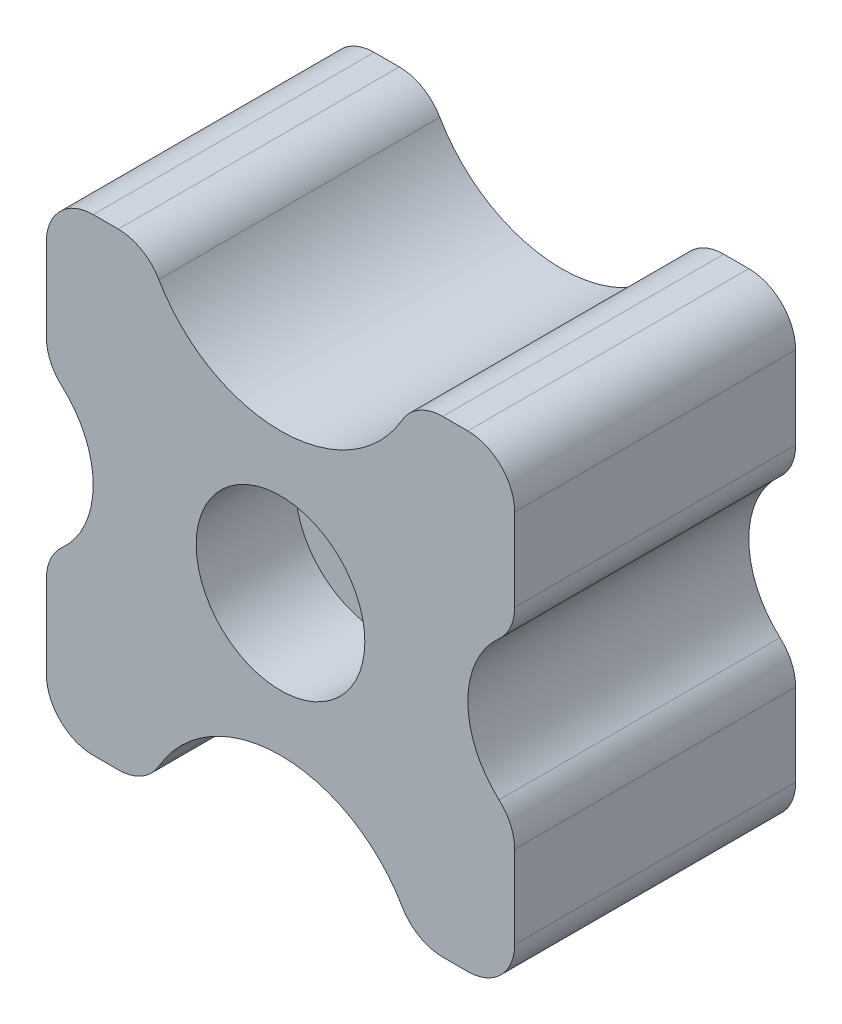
ISO-10303-21;
HEADER;
FILE_DESCRIPTION(('STEP AP214'),'2;1');
FILE_NAME('part.step','',(''),(''),'','','');
FILE_SCHEMA(('AUTOMOTIVE_DESIGN { 1 0 10303 214 1 1 1 1 }'));
ENDSEC;
DATA;
#1=APPLICATION_CONTEXT('core data for automotive mechanical design processes');
#2=APPLICATION_PROTOCOL_DEFINITION('international standard','automotive_design',2000,#1);
#3=PRODUCT_CONTEXT('',#1,'mechanical');
#4=PRODUCT('Part','Part','',(#3));
#5=PRODUCT_RELATED_PRODUCT_CATEGORY('part','',(#4));
#6=PRODUCT_DEFINITION_FORMATION('','',#4);
#7=PRODUCT_DEFINITION_CONTEXT('part definition',#1,'design');
#8=PRODUCT_DEFINITION('design','',#6,#7);
#9=PRODUCT_DEFINITION_SHAPE('','',#8);
#10=(LENGTH_UNIT() NAMED_UNIT(*) SI_UNIT(.MILLI.,.METRE.));
#11=(NAMED_UNIT(*) PLANE_ANGLE_UNIT() SI_UNIT($,.RADIAN.));
#12=(NAMED_UNIT(*) SI_UNIT($,.STERADIAN.) SOLID_ANGLE_UNIT());
#13=UNCERTAINTY_MEASURE_WITH_UNIT(LENGTH_MEASURE(1.E-05),#10,'distance_accuracy_value','');
#14=(GEOMETRIC_REPRESENTATION_CONTEXT(3) GLOBAL_UNCERTAINTY_ASSIGNED_CONTEXT((#13)) GLOBAL_UNIT_ASSIGNED_CONTEXT((#10,
#11,#12)) REPRESENTATION_CONTEXT('',''));
#15=CARTESIAN_POINT('',(0.,0.,0.));
#16=DIRECTION('',(0.,0.,1.));
#17=DIRECTION('',(1.,0.,0.));
#18=AXIS2_PLACEMENT_3D('',#15,#16,#17);
#19=CARTESIAN_POINT('',(25.,25.,30.));
#20=DIRECTION('',(0.,0.,-1.));
#21=DIRECTION('',(-1.,0.,0.));
#22=AXIS2_PLACEMENT_3D('',#19,#20,#21);
#23=PLANE('',#22);
#24=CARTESIAN_POINT('',(0.,0.,30.));
#25=DIRECTION('',(0.,0.,1.));
#26=DIRECTION('',(1.,0.,0.));
#27=AXIS2_PLACEMENT_3D('',#24,#25,#26);
#28=CIRCLE('',#27,9.);
#29=CARTESIAN_POINT('',(9.,0.,30.));
#30=VERTEX_POINT('',#29);
#31=EDGE_CURVE('E490',#30,#30,#28,.T.);
#32=ORIENTED_EDGE('',*,*,#31,.F.);
#33=EDGE_LOOP('',(#32));
#34=FACE_BOUND('',#33,.T.);
#35=DIRECTION('',(1.,0.,0.));
#36=VECTOR('',#35,1.);
#37=CARTESIAN_POINT('',(-25.,-25.,30.));
#38=LINE('',#37,#36);
#39=CARTESIAN_POINT('',(17.3205080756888,-25.,30.));
#40=VERTEX_POINT('',#39);
#41=CARTESIAN_POINT('',(20.,-25.,30.));
#42=VERTEX_POINT('',#41);
#43=EDGE_CURVE('E206',#40,#42,#38,.T.);
#44=ORIENTED_EDGE('',*,*,#43,.T.);
#45=CARTESIAN_POINT('',(20.,-20.,30.));
#46=DIRECTION('',(0.,0.,-1.));
#47=DIRECTION('',(-1.,0.,0.));
#48=AXIS2_PLACEMENT_3D('',#45,#46,#47);
#49=CIRCLE('',#48,5.);
#50=CARTESIAN_POINT('',(25.,-20.,30.));
#51=VERTEX_POINT('',#50);
#52=EDGE_CURVE('E200',#42,#51,#49,.F.);
#53=ORIENTED_EDGE('',*,*,#52,.T.);
#54=DIRECTION('',(0.,1.,0.));
#55=VECTOR('',#54,1.);
#56=CARTESIAN_POINT('',(25.,-25.,30.));
#57=LINE('',#56,#55);
#58=CARTESIAN_POINT('',(25.,-11.180339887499,30.));
#59=VERTEX_POINT('',#58);
#60=EDGE_CURVE('E203',#51,#59,#57,.T.);
#61=ORIENTED_EDGE('',*,*,#60,.T.);
#62=CARTESIAN_POINT('',(20.,-11.180339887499,30.));
#63=DIRECTION('',(0.,0.,-1.));
#64=DIRECTION('',(-1.,0.,0.));
#65=AXIS2_PLACEMENT_3D('',#62,#63,#64);
#66=CIRCLE('',#65,5.);
#67=CARTESIAN_POINT('',(23.3333333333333,-7.4535599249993,30.));
#68=VERTEX_POINT('',#67);
#69=EDGE_CURVE('E274',#59,#68,#66,.F.);
#70=ORIENTED_EDGE('',*,*,#69,.T.);
#71=CARTESIAN_POINT('',(30.,0.,30.));
#72=DIRECTION('',(0.,0.,1.));
#73=DIRECTION('',(-1.,0.,0.));
#74=AXIS2_PLACEMENT_3D('',#71,#72,#73);
#75=CIRCLE('',#74,10.);
#76=CARTESIAN_POINT('',(23.3333333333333,7.45355992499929,30.));
#77=VERTEX_POINT('',#76);
#78=EDGE_CURVE('E462',#77,#68,#75,.T.);
#79=ORIENTED_EDGE('',*,*,#78,.F.);
#80=CARTESIAN_POINT('',(20.,11.1803398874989,30.));
#81=DIRECTION('',(0.,0.,-1.));
#82=DIRECTION('',(-1.,0.,0.));
#83=AXIS2_PLACEMENT_3D('',#80,#81,#82);
#84=CIRCLE('',#83,5.);
#85=CARTESIAN_POINT('',(25.,11.1803398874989,30.));
#86=VERTEX_POINT('',#85);
#87=EDGE_CURVE('E271',#77,#86,#84,.F.);
#88=ORIENTED_EDGE('',*,*,#87,.T.);
#89=CARTESIAN_POINT('',(25.,20.,30.));
#90=VERTEX_POINT('',#89);
#91=EDGE_CURVE('E224',#86,#90,#57,.T.);
#92=ORIENTED_EDGE('',*,*,#91,.T.);
#93=CARTESIAN_POINT('',(20.,20.,30.));
#94=DIRECTION('',(0.,0.,-1.));
#95=DIRECTION('',(-1.,0.,0.));
#96=AXIS2_PLACEMENT_3D('',#93,#94,#95);
#97=CIRCLE('',#96,5.);
#98=CARTESIAN_POINT('',(20.,25.,30.));
#99=VERTEX_POINT('',#98);
#100=EDGE_CURVE('E60',#90,#99,#97,.F.);
#101=ORIENTED_EDGE('',*,*,#100,.T.);
#102=DIRECTION('',(-1.,0.,0.));
#103=VECTOR('',#102,1.);
#104=CARTESIAN_POINT('',(-25.,25.,30.));
#105=LINE('',#104,#103);
#106=CARTESIAN_POINT('',(17.3205080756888,25.,30.));
#107=VERTEX_POINT('',#106);
#108=EDGE_CURVE('E352',#99,#107,#105,.T.);
#109=ORIENTED_EDGE('',*,*,#108,.T.);
#110=CARTESIAN_POINT('',(17.3205080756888,20.,30.));
#111=DIRECTION('',(0.,0.,-1.));
#112=DIRECTION('',(-1.,0.,0.));
#113=AXIS2_PLACEMENT_3D('',#110,#111,#112);
#114=CIRCLE('',#113,5.);
#115=CARTESIAN_POINT('',(12.9903810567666,22.5,30.));
#116=VERTEX_POINT('',#115);
#117=EDGE_CURVE('E266',#107,#116,#114,.F.);
#118=ORIENTED_EDGE('',*,*,#117,.T.);
#119=CARTESIAN_POINT('',(0.,30.,30.));
#120=DIRECTION('',(0.,0.,1.));
#121=DIRECTION('',(-1.,0.,0.));
#122=AXIS2_PLACEMENT_3D('',#119,#120,#121);
#123=CIRCLE('',#122,15.);
#124=CARTESIAN_POINT('',(-12.9903810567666,22.5,30.));
#125=VERTEX_POINT('',#124);
#126=EDGE_CURVE('E471',#125,#116,#123,.T.);
#127=ORIENTED_EDGE('',*,*,#126,.F.);
#128=CARTESIAN_POINT('',(-17.3205080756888,20.,30.));
#129=DIRECTION('',(0.,0.,-1.));
#130=DIRECTION('',(-1.,0.,0.));
#131=AXIS2_PLACEMENT_3D('',#128,#129,#130);
#132=CIRCLE('',#131,5.);
#133=CARTESIAN_POINT('',(-17.3205080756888,25.,30.));
#134=VERTEX_POINT('',#133);
#135=EDGE_CURVE('E263',#125,#134,#132,.F.);
#136=ORIENTED_EDGE('',*,*,#135,.T.);
#137=CARTESIAN_POINT('',(-20.,25.,30.));
#138=VERTEX_POINT('',#137);
#139=EDGE_CURVE('E223',#134,#138,#105,.T.);
#140=ORIENTED_EDGE('',*,*,#139,.T.);
#141=CARTESIAN_POINT('',(-20.,20.,30.));
#142=DIRECTION('',(0.,0.,-1.));
#143=DIRECTION('',(-1.,0.,0.));
#144=AXIS2_PLACEMENT_3D('',#141,#142,#143);
#145=CIRCLE('',#144,5.);
#146=CARTESIAN_POINT('',(-25.,20.,30.));
#147=VERTEX_POINT('',#146);
#148=EDGE_CURVE('E260',#138,#147,#145,.F.);
#149=ORIENTED_EDGE('',*,*,#148,.T.);
#150=DIRECTION('',(0.,-1.,0.));
#151=VECTOR('',#150,1.);
#152=CARTESIAN_POINT('',(-25.,-25.,30.));
#153=LINE('',#152,#151);
#154=CARTESIAN_POINT('',(-25.,11.1803398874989,30.));
#155=VERTEX_POINT('',#154);
#156=EDGE_CURVE('E361',#147,#155,#153,.T.);
#157=ORIENTED_EDGE('',*,*,#156,.T.);
#158=CARTESIAN_POINT('',(-20.,11.1803398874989,30.));
#159=DIRECTION('',(0.,0.,-1.));
#160=DIRECTION('',(-1.,0.,0.));
#161=AXIS2_PLACEMENT_3D('',#158,#159,#160);
#162=CIRCLE('',#161,5.);
#163=CARTESIAN_POINT('',(-23.3333333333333,7.4535599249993,30.));
#164=VERTEX_POINT('',#163);
#165=EDGE_CURVE('E212',#155,#164,#162,.F.);
#166=ORIENTED_EDGE('',*,*,#165,.T.);
#167=CARTESIAN_POINT('',(-30.,0.,30.));
#168=DIRECTION('',(0.,0.,1.));
#169=DIRECTION('',(1.,0.,0.));
#170=AXIS2_PLACEMENT_3D('',#167,#168,#169);
#171=CIRCLE('',#170,10.);
#172=CARTESIAN_POINT('',(-23.3333333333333,-7.45355992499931,30.));
#173=VERTEX_POINT('',#172);
#174=EDGE_CURVE('E390',#173,#164,#171,.T.);
#175=ORIENTED_EDGE('',*,*,#174,.F.);
#176=CARTESIAN_POINT('',(-20.,-11.180339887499,30.));
#177=DIRECTION('',(0.,0.,-1.));
#178=DIRECTION('',(-1.,0.,0.));
#179=AXIS2_PLACEMENT_3D('',#176,#177,#178);
#180=CIRCLE('',#179,5.);
#181=CARTESIAN_POINT('',(-25.,-11.180339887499,30.));
#182=VERTEX_POINT('',#181);
#183=EDGE_CURVE('E286',#173,#182,#180,.F.);
#184=ORIENTED_EDGE('',*,*,#183,.T.);
#185=CARTESIAN_POINT('',(-25.,-20.,30.));
#186=VERTEX_POINT('',#185);
#187=EDGE_CURVE('E386',#182,#186,#153,.T.);
#188=ORIENTED_EDGE('',*,*,#187,.T.);
#189=CARTESIAN_POINT('',(-20.,-20.,30.));
#190=DIRECTION('',(0.,0.,-1.));
#191=DIRECTION('',(-1.,0.,0.));
#192=AXIS2_PLACEMENT_3D('',#189,#190,#191);
#193=CIRCLE('',#192,5.);
#194=CARTESIAN_POINT('',(-20.,-25.,30.));
#195=VERTEX_POINT('',#194);
#196=EDGE_CURVE('E283',#186,#195,#193,.F.);
#197=ORIENTED_EDGE('',*,*,#196,.T.);
#198=CARTESIAN_POINT('',(-17.3205080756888,-25.,30.));
#199=VERTEX_POINT('',#198);
#200=EDGE_CURVE('E376',#195,#199,#38,.T.);
#201=ORIENTED_EDGE('',*,*,#200,.T.);
#202=CARTESIAN_POINT('',(-17.3205080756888,-20.,30.));
#203=DIRECTION('',(0.,0.,-1.));
#204=DIRECTION('',(-1.,0.,0.));
#205=AXIS2_PLACEMENT_3D('',#202,#203,#204);
#206=CIRCLE('',#205,5.);
#207=CARTESIAN_POINT('',(-12.9903810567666,-22.5,30.));
#208=VERTEX_POINT('',#207);
#209=EDGE_CURVE('E277',#199,#208,#206,.F.);
#210=ORIENTED_EDGE('',*,*,#209,.T.);
#211=CARTESIAN_POINT('',(0.,-30.,30.));
#212=DIRECTION('',(0.,0.,1.));
#213=DIRECTION('',(1.,0.,0.));
#214=AXIS2_PLACEMENT_3D('',#211,#212,#213);
#215=CIRCLE('',#214,15.);
#216=CARTESIAN_POINT('',(12.9903810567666,-22.5,30.));
#217=VERTEX_POINT('',#216);
#218=EDGE_CURVE('E396',#217,#208,#215,.T.);
#219=ORIENTED_EDGE('',*,*,#218,.F.);
#220=CARTESIAN_POINT('',(17.3205080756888,-20.,30.));
#221=DIRECTION('',(0.,0.,-1.));
#222=DIRECTION('',(-1.,0.,0.));
#223=AXIS2_PLACEMENT_3D('',#220,#221,#222);
#224=CIRCLE('',#223,5.);
#225=EDGE_CURVE('E280',#217,#40,#224,.F.);
#226=ORIENTED_EDGE('',*,*,#225,.T.);
#227=EDGE_LOOP('',(#44,#53,#61,#70,#79,#88,#92,#101,#109,#118,#127,#136,#140,#149,#157,#166,
#175,#184,#188,#197,#201,#210,#219,#226));
#228=FACE_BOUND('',#227,.T.);
#229=ADVANCED_FACE('F38',(#34,#228),#23,.F.);
#230=CARTESIAN_POINT('',(25.,25.,0.));
#231=DIRECTION('',(0.,0.,-1.));
#232=DIRECTION('',(-1.,0.,0.));
#233=AXIS2_PLACEMENT_3D('',#230,#231,#232);
#234=PLANE('',#233);
#235=CARTESIAN_POINT('',(0.,0.,0.));
#236=DIRECTION('',(0.,0.,1.));
#237=DIRECTION('',(1.,0.,0.));
#238=AXIS2_PLACEMENT_3D('',#235,#236,#237);
#239=CIRCLE('',#238,5.49999999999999);
#240=CARTESIAN_POINT('',(5.49999999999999,0.,0.));
#241=VERTEX_POINT('',#240);
#242=EDGE_CURVE('E477',#241,#241,#239,.T.);
#243=ORIENTED_EDGE('',*,*,#242,.T.);
#244=EDGE_LOOP('',(#243));
#245=FACE_BOUND('',#244,.T.);
#246=DIRECTION('',(0.,1.,0.));
#247=VECTOR('',#246,1.);
#248=CARTESIAN_POINT('',(25.,-25.,0.));
#249=LINE('',#248,#247);
#250=CARTESIAN_POINT('',(25.,-20.,0.));
#251=VERTEX_POINT('',#250);
#252=CARTESIAN_POINT('',(25.,-11.180339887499,0.));
#253=VERTEX_POINT('',#252);
#254=EDGE_CURVE('E389',#251,#253,#249,.T.);
#255=ORIENTED_EDGE('',*,*,#254,.F.);
#256=CARTESIAN_POINT('',(20.,-20.,0.));
#257=DIRECTION('',(0.,0.,-1.));
#258=DIRECTION('',(-1.,0.,0.));
#259=AXIS2_PLACEMENT_3D('',#256,#257,#258);
#260=CIRCLE('',#259,5.);
#261=CARTESIAN_POINT('',(20.,-25.,0.));
#262=VERTEX_POINT('',#261);
#263=EDGE_CURVE('E227',#251,#262,#260,.T.);
#264=ORIENTED_EDGE('',*,*,#263,.T.);
#265=DIRECTION('',(1.,0.,0.));
#266=VECTOR('',#265,1.);
#267=CARTESIAN_POINT('',(-25.,-25.,0.));
#268=LINE('',#267,#266);
#269=CARTESIAN_POINT('',(17.3205080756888,-25.,0.));
#270=VERTEX_POINT('',#269);
#271=EDGE_CURVE('E365',#270,#262,#268,.T.);
#272=ORIENTED_EDGE('',*,*,#271,.F.);
#273=CARTESIAN_POINT('',(17.3205080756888,-20.,0.));
#274=DIRECTION('',(0.,0.,-1.));
#275=DIRECTION('',(-1.,0.,0.));
#276=AXIS2_PLACEMENT_3D('',#273,#274,#275);
#277=CIRCLE('',#276,5.);
#278=CARTESIAN_POINT('',(12.9903810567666,-22.5,0.));
#279=VERTEX_POINT('',#278);
#280=EDGE_CURVE('E247',#270,#279,#277,.T.);
#281=ORIENTED_EDGE('',*,*,#280,.T.);
#282=CARTESIAN_POINT('',(0.,-30.,0.));
#283=DIRECTION('',(0.,0.,1.));
#284=DIRECTION('',(1.,0.,0.));
#285=AXIS2_PLACEMENT_3D('',#282,#283,#284);
#286=CIRCLE('',#285,15.);
#287=CARTESIAN_POINT('',(-12.9903810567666,-22.5,0.));
#288=VERTEX_POINT('',#287);
#289=EDGE_CURVE('E404',#279,#288,#286,.T.);
#290=ORIENTED_EDGE('',*,*,#289,.T.);
#291=CARTESIAN_POINT('',(-17.3205080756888,-20.,0.));
#292=DIRECTION('',(0.,0.,-1.));
#293=DIRECTION('',(-1.,0.,0.));
#294=AXIS2_PLACEMENT_3D('',#291,#292,#293);
#295=CIRCLE('',#294,5.);
#296=CARTESIAN_POINT('',(-17.3205080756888,-25.,0.));
#297=VERTEX_POINT('',#296);
#298=EDGE_CURVE('E245',#288,#297,#295,.T.);
#299=ORIENTED_EDGE('',*,*,#298,.T.);
#300=CARTESIAN_POINT('',(-20.,-25.,0.));
#301=VERTEX_POINT('',#300);
#302=EDGE_CURVE('E369',#301,#297,#268,.T.);
#303=ORIENTED_EDGE('',*,*,#302,.F.);
#304=CARTESIAN_POINT('',(-20.,-20.,0.));
#305=DIRECTION('',(0.,0.,-1.));
#306=DIRECTION('',(-1.,0.,0.));
#307=AXIS2_PLACEMENT_3D('',#304,#305,#306);
#308=CIRCLE('',#307,5.);
#309=CARTESIAN_POINT('',(-25.,-20.,0.));
#310=VERTEX_POINT('',#309);
#311=EDGE_CURVE('E249',#301,#310,#308,.T.);
#312=ORIENTED_EDGE('',*,*,#311,.T.);
#313=DIRECTION('',(0.,-1.,0.));
#314=VECTOR('',#313,1.);
#315=CARTESIAN_POINT('',(-25.,-25.,0.));
#316=LINE('',#315,#314);
#317=CARTESIAN_POINT('',(-25.,-11.180339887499,0.));
#318=VERTEX_POINT('',#317);
#319=EDGE_CURVE('E366',#318,#310,#316,.T.);
#320=ORIENTED_EDGE('',*,*,#319,.F.);
#321=CARTESIAN_POINT('',(-20.,-11.180339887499,0.));
#322=DIRECTION('',(0.,0.,-1.));
#323=DIRECTION('',(-1.,0.,0.));
#324=AXIS2_PLACEMENT_3D('',#321,#322,#323);
#325=CIRCLE('',#324,5.);
#326=CARTESIAN_POINT('',(-23.3333333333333,-7.45355992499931,0.));
#327=VERTEX_POINT('',#326);
#328=EDGE_CURVE('E251',#318,#327,#325,.T.);
#329=ORIENTED_EDGE('',*,*,#328,.T.);
#330=CARTESIAN_POINT('',(-30.,0.,0.));
#331=DIRECTION('',(0.,0.,-1.));
#332=DIRECTION('',(-1.,0.,0.));
#333=AXIS2_PLACEMENT_3D('',#330,#331,#332);
#334=CIRCLE('',#333,10.);
#335=CARTESIAN_POINT('',(-23.3333333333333,7.4535599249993,0.));
#336=VERTEX_POINT('',#335);
#337=EDGE_CURVE('E232',#327,#336,#334,.F.);
#338=ORIENTED_EDGE('',*,*,#337,.T.);
#339=CARTESIAN_POINT('',(-20.,11.1803398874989,0.));
#340=DIRECTION('',(0.,0.,-1.));
#341=DIRECTION('',(-1.,0.,0.));
#342=AXIS2_PLACEMENT_3D('',#339,#340,#341);
#343=CIRCLE('',#342,5.);
#344=CARTESIAN_POINT('',(-25.,11.1803398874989,0.));
#345=VERTEX_POINT('',#344);
#346=EDGE_CURVE('E253',#336,#345,#343,.T.);
#347=ORIENTED_EDGE('',*,*,#346,.T.);
#348=CARTESIAN_POINT('',(-25.,20.,0.));
#349=VERTEX_POINT('',#348);
#350=EDGE_CURVE('E359',#349,#345,#316,.T.);
#351=ORIENTED_EDGE('',*,*,#350,.F.);
#352=CARTESIAN_POINT('',(-20.,20.,0.));
#353=DIRECTION('',(0.,0.,-1.));
#354=DIRECTION('',(-1.,0.,0.));
#355=AXIS2_PLACEMENT_3D('',#352,#353,#354);
#356=CIRCLE('',#355,5.);
#357=CARTESIAN_POINT('',(-20.,25.,0.));
#358=VERTEX_POINT('',#357);
#359=EDGE_CURVE('E228',#349,#358,#356,.T.);
#360=ORIENTED_EDGE('',*,*,#359,.T.);
#361=DIRECTION('',(-1.,0.,0.));
#362=VECTOR('',#361,1.);
#363=CARTESIAN_POINT('',(-25.,25.,0.));
#364=LINE('',#363,#362);
#365=CARTESIAN_POINT('',(-17.3205080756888,25.,0.));
#366=VERTEX_POINT('',#365);
#367=EDGE_CURVE('E345',#366,#358,#364,.T.);
#368=ORIENTED_EDGE('',*,*,#367,.F.);
#369=CARTESIAN_POINT('',(-17.3205080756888,20.,0.));
#370=DIRECTION('',(0.,0.,-1.));
#371=DIRECTION('',(-1.,0.,0.));
#372=AXIS2_PLACEMENT_3D('',#369,#370,#371);
#373=CIRCLE('',#372,5.);
#374=CARTESIAN_POINT('',(-12.9903810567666,22.5,0.));
#375=VERTEX_POINT('',#374);
#376=EDGE_CURVE('E230',#366,#375,#373,.T.);
#377=ORIENTED_EDGE('',*,*,#376,.T.);
#378=CARTESIAN_POINT('',(0.,30.,0.));
#379=DIRECTION('',(0.,0.,1.));
#380=DIRECTION('',(-1.,0.,0.));
#381=AXIS2_PLACEMENT_3D('',#378,#379,#380);
#382=CIRCLE('',#381,15.);
#383=CARTESIAN_POINT('',(12.9903810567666,22.5,0.));
#384=VERTEX_POINT('',#383);
#385=EDGE_CURVE('E474',#375,#384,#382,.T.);
#386=ORIENTED_EDGE('',*,*,#385,.T.);
#387=CARTESIAN_POINT('',(17.3205080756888,20.,0.));
#388=DIRECTION('',(0.,0.,-1.));
#389=DIRECTION('',(-1.,0.,0.));
#390=AXIS2_PLACEMENT_3D('',#387,#388,#389);
#391=CIRCLE('',#390,5.);
#392=CARTESIAN_POINT('',(17.3205080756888,25.,0.));
#393=VERTEX_POINT('',#392);
#394=EDGE_CURVE('E237',#384,#393,#391,.T.);
#395=ORIENTED_EDGE('',*,*,#394,.T.);
#396=CARTESIAN_POINT('',(20.,25.,0.));
#397=VERTEX_POINT('',#396);
#398=EDGE_CURVE('E372',#397,#393,#364,.T.);
#399=ORIENTED_EDGE('',*,*,#398,.F.);
#400=CARTESIAN_POINT('',(20.,20.,0.));
#401=DIRECTION('',(0.,0.,-1.));
#402=DIRECTION('',(-1.,0.,0.));
#403=AXIS2_PLACEMENT_3D('',#400,#401,#402);
#404=CIRCLE('',#403,5.);
#405=CARTESIAN_POINT('',(25.,20.,0.));
#406=VERTEX_POINT('',#405);
#407=EDGE_CURVE('E239',#397,#406,#404,.T.);
#408=ORIENTED_EDGE('',*,*,#407,.T.);
#409=CARTESIAN_POINT('',(25.,11.1803398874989,0.));
#410=VERTEX_POINT('',#409);
#411=EDGE_CURVE('E387',#410,#406,#249,.T.);
#412=ORIENTED_EDGE('',*,*,#411,.F.);
#413=CARTESIAN_POINT('',(20.,11.1803398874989,0.));
#414=DIRECTION('',(0.,0.,-1.));
#415=DIRECTION('',(-1.,0.,0.));
#416=AXIS2_PLACEMENT_3D('',#413,#414,#415);
#417=CIRCLE('',#416,5.);
#418=CARTESIAN_POINT('',(23.3333333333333,7.45355992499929,0.));
#419=VERTEX_POINT('',#418);
#420=EDGE_CURVE('E241',#410,#419,#417,.T.);
#421=ORIENTED_EDGE('',*,*,#420,.T.);
#422=CARTESIAN_POINT('',(30.,0.,0.));
#423=DIRECTION('',(0.,0.,1.));
#424=DIRECTION('',(-1.,0.,0.));
#425=AXIS2_PLACEMENT_3D('',#422,#423,#424);
#426=CIRCLE('',#425,10.);
#427=CARTESIAN_POINT('',(23.3333333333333,-7.4535599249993,0.));
#428=VERTEX_POINT('',#427);
#429=EDGE_CURVE('E468',#419,#428,#426,.T.);
#430=ORIENTED_EDGE('',*,*,#429,.T.);
#431=CARTESIAN_POINT('',(20.,-11.180339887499,0.));
#432=DIRECTION('',(0.,0.,-1.));
#433=DIRECTION('',(-1.,0.,0.));
#434=AXIS2_PLACEMENT_3D('',#431,#432,#433);
#435=CIRCLE('',#434,5.);
#436=EDGE_CURVE('E243',#428,#253,#435,.T.);
#437=ORIENTED_EDGE('',*,*,#436,.T.);
#438=EDGE_LOOP('',(#255,#264,#272,#281,#290,#299,#303,#312,#320,#329,#338,#347,#351,#360,#368,
#377,#386,#395,#399,#408,#412,#421,#430,#437));
#439=FACE_BOUND('',#438,.T.);
#440=ADVANCED_FACE('F363',(#245,#439),#234,.T.);
#441=CARTESIAN_POINT('',(-25.,25.,30.));
#442=DIRECTION('',(0.,-1.,0.));
#443=DIRECTION('',(0.,0.,-1.));
#444=AXIS2_PLACEMENT_3D('',#441,#442,#443);
#445=PLANE('',#444);
#446=ORIENTED_EDGE('',*,*,#139,.F.);
#447=DIRECTION('',(0.,0.,1.));
#448=VECTOR('',#447,1.);
#449=CARTESIAN_POINT('',(-17.3205080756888,25.,0.));
#450=LINE('',#449,#448);
#451=EDGE_CURVE('E11',#134,#366,#450,.F.);
#452=ORIENTED_EDGE('',*,*,#451,.T.);
#453=ORIENTED_EDGE('',*,*,#367,.T.);
#454=DIRECTION('',(0.,0.,-1.));
#455=VECTOR('',#454,1.);
#456=CARTESIAN_POINT('',(-20.,25.,30.));
#457=LINE('',#456,#455);
#458=EDGE_CURVE('E46',#358,#138,#457,.F.);
#459=ORIENTED_EDGE('',*,*,#458,.T.);
#460=EDGE_LOOP('',(#446,#452,#453,#459));
#461=FACE_BOUND('',#460,.T.);
#462=ADVANCED_FACE('F342',(#461),#445,.F.);
#463=ORIENTED_EDGE('',*,*,#108,.F.);
#464=DIRECTION('',(0.,0.,-1.));
#465=VECTOR('',#464,1.);
#466=CARTESIAN_POINT('',(20.,25.,30.));
#467=LINE('',#466,#465);
#468=EDGE_CURVE('E329',#99,#397,#467,.T.);
#469=ORIENTED_EDGE('',*,*,#468,.T.);
#470=ORIENTED_EDGE('',*,*,#398,.T.);
#471=DIRECTION('',(0.,0.,1.));
#472=VECTOR('',#471,1.);
#473=CARTESIAN_POINT('',(17.3205080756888,25.,30.));
#474=LINE('',#473,#472);
#475=EDGE_CURVE('E53',#393,#107,#474,.T.);
#476=ORIENTED_EDGE('',*,*,#475,.T.);
#477=EDGE_LOOP('',(#463,#469,#470,#476));
#478=FACE_BOUND('',#477,.T.);
#479=ADVANCED_FACE('F512',(#478),#445,.F.);
#480=CARTESIAN_POINT('',(25.,-25.,30.));
#481=DIRECTION('',(-1.,0.,0.));
#482=DIRECTION('',(0.,0.,1.));
#483=AXIS2_PLACEMENT_3D('',#480,#481,#482);
#484=PLANE('',#483);
#485=ORIENTED_EDGE('',*,*,#91,.F.);
#486=DIRECTION('',(0.,0.,1.));
#487=VECTOR('',#486,1.);
#488=CARTESIAN_POINT('',(25.,11.1803398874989,0.));
#489=LINE('',#488,#487);
#490=EDGE_CURVE('E326',#86,#410,#489,.F.);
#491=ORIENTED_EDGE('',*,*,#490,.T.);
#492=ORIENTED_EDGE('',*,*,#411,.T.);
#493=DIRECTION('',(0.,0.,-1.));
#494=VECTOR('',#493,1.);
#495=CARTESIAN_POINT('',(25.,20.,30.));
#496=LINE('',#495,#494);
#497=EDGE_CURVE('E324',#406,#90,#496,.F.);
#498=ORIENTED_EDGE('',*,*,#497,.T.);
#499=EDGE_LOOP('',(#485,#491,#492,#498));
#500=FACE_BOUND('',#499,.T.);
#501=ADVANCED_FACE('F513',(#500),#484,.F.);
#502=ORIENTED_EDGE('',*,*,#60,.F.);
#503=DIRECTION('',(0.,0.,-1.));
#504=VECTOR('',#503,1.);
#505=CARTESIAN_POINT('',(25.,-20.,30.));
#506=LINE('',#505,#504);
#507=EDGE_CURVE('E218',#51,#251,#506,.T.);
#508=ORIENTED_EDGE('',*,*,#507,.T.);
#509=ORIENTED_EDGE('',*,*,#254,.T.);
#510=DIRECTION('',(0.,0.,1.));
#511=VECTOR('',#510,1.);
#512=CARTESIAN_POINT('',(25.,-11.180339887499,30.));
#513=LINE('',#512,#511);
#514=EDGE_CURVE('E221',#253,#59,#513,.T.);
#515=ORIENTED_EDGE('',*,*,#514,.T.);
#516=EDGE_LOOP('',(#502,#508,#509,#515));
#517=FACE_BOUND('',#516,.T.);
#518=ADVANCED_FACE('F216',(#517),#484,.F.);
#519=CARTESIAN_POINT('',(-25.,-25.,30.));
#520=DIRECTION('',(0.,1.,0.));
#521=DIRECTION('',(0.,0.,1.));
#522=AXIS2_PLACEMENT_3D('',#519,#520,#521);
#523=PLANE('',#522);
#524=ORIENTED_EDGE('',*,*,#271,.T.);
#525=DIRECTION('',(0.,0.,-1.));
#526=VECTOR('',#525,1.);
#527=CARTESIAN_POINT('',(20.,-25.,30.));
#528=LINE('',#527,#526);
#529=EDGE_CURVE('E258',#262,#42,#528,.F.);
#530=ORIENTED_EDGE('',*,*,#529,.T.);
#531=ORIENTED_EDGE('',*,*,#43,.F.);
#532=DIRECTION('',(0.,0.,1.));
#533=VECTOR('',#532,1.);
#534=CARTESIAN_POINT('',(17.3205080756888,-25.,0.));
#535=LINE('',#534,#533);
#536=EDGE_CURVE('E256',#40,#270,#535,.F.);
#537=ORIENTED_EDGE('',*,*,#536,.T.);
#538=EDGE_LOOP('',(#524,#530,#531,#537));
#539=FACE_BOUND('',#538,.T.);
#540=ADVANCED_FACE('F454',(#539),#523,.F.);
#541=ORIENTED_EDGE('',*,*,#200,.F.);
#542=DIRECTION('',(0.,0.,-1.));
#543=VECTOR('',#542,1.);
#544=CARTESIAN_POINT('',(-20.,-25.,30.));
#545=LINE('',#544,#543);
#546=EDGE_CURVE('E308',#195,#301,#545,.T.);
#547=ORIENTED_EDGE('',*,*,#546,.T.);
#548=ORIENTED_EDGE('',*,*,#302,.T.);
#549=DIRECTION('',(0.,0.,1.));
#550=VECTOR('',#549,1.);
#551=CARTESIAN_POINT('',(-17.3205080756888,-25.,30.));
#552=LINE('',#551,#550);
#553=EDGE_CURVE('E306',#297,#199,#552,.T.);
#554=ORIENTED_EDGE('',*,*,#553,.T.);
#555=EDGE_LOOP('',(#541,#547,#548,#554));
#556=FACE_BOUND('',#555,.T.);
#557=ADVANCED_FACE('F437',(#556),#523,.F.);
#558=CARTESIAN_POINT('',(-25.,-25.,30.));
#559=DIRECTION('',(1.,0.,0.));
#560=DIRECTION('',(0.,0.,-1.));
#561=AXIS2_PLACEMENT_3D('',#558,#559,#560);
#562=PLANE('',#561);
#563=ORIENTED_EDGE('',*,*,#187,.F.);
#564=DIRECTION('',(0.,0.,1.));
#565=VECTOR('',#564,1.);
#566=CARTESIAN_POINT('',(-25.,-11.180339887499,0.));
#567=LINE('',#566,#565);
#568=EDGE_CURVE('E303',#182,#318,#567,.F.);
#569=ORIENTED_EDGE('',*,*,#568,.T.);
#570=ORIENTED_EDGE('',*,*,#319,.T.);
#571=DIRECTION('',(0.,0.,-1.));
#572=VECTOR('',#571,1.);
#573=CARTESIAN_POINT('',(-25.,-20.,30.));
#574=LINE('',#573,#572);
#575=EDGE_CURVE('E301',#310,#186,#574,.F.);
#576=ORIENTED_EDGE('',*,*,#575,.T.);
#577=EDGE_LOOP('',(#563,#569,#570,#576));
#578=FACE_BOUND('',#577,.T.);
#579=ADVANCED_FACE('F430',(#578),#562,.F.);
#580=ORIENTED_EDGE('',*,*,#350,.T.);
#581=DIRECTION('',(0.,0.,1.));
#582=VECTOR('',#581,1.);
#583=CARTESIAN_POINT('',(-25.,11.1803398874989,30.));
#584=LINE('',#583,#582);
#585=EDGE_CURVE('E299',#345,#155,#584,.T.);
#586=ORIENTED_EDGE('',*,*,#585,.T.);
#587=ORIENTED_EDGE('',*,*,#156,.F.);
#588=DIRECTION('',(0.,0.,-1.));
#589=VECTOR('',#588,1.);
#590=CARTESIAN_POINT('',(-25.,20.,30.));
#591=LINE('',#590,#589);
#592=EDGE_CURVE('E296',#147,#349,#591,.T.);
#593=ORIENTED_EDGE('',*,*,#592,.T.);
#594=EDGE_LOOP('',(#580,#586,#587,#593));
#595=FACE_BOUND('',#594,.T.);
#596=ADVANCED_FACE('F358',(#595),#562,.F.);
#597=CARTESIAN_POINT('',(-30.,0.,30.));
#598=DIRECTION('',(0.,0.,-1.));
#599=DIRECTION('',(-1.,0.,0.));
#600=AXIS2_PLACEMENT_3D('',#597,#598,#599);
#601=CYLINDRICAL_SURFACE('',#600,10.);
#602=ORIENTED_EDGE('',*,*,#174,.T.);
#603=DIRECTION('',(0.,0.,-1.));
#604=VECTOR('',#603,1.);
#605=CARTESIAN_POINT('',(-23.3333333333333,7.4535599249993,30.));
#606=LINE('',#605,#604);
#607=EDGE_CURVE('E293',#164,#336,#606,.T.);
#608=ORIENTED_EDGE('',*,*,#607,.T.);
#609=ORIENTED_EDGE('',*,*,#337,.F.);
#610=DIRECTION('',(0.,0.,-1.));
#611=VECTOR('',#610,1.);
#612=CARTESIAN_POINT('',(-23.3333333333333,-7.45355992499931,30.));
#613=LINE('',#612,#611);
#614=EDGE_CURVE('E211',#327,#173,#613,.F.);
#615=ORIENTED_EDGE('',*,*,#614,.T.);
#616=EDGE_LOOP('',(#602,#608,#609,#615));
#617=FACE_BOUND('',#616,.T.);
#618=ADVANCED_FACE('F422',(#617),#601,.F.);
#619=CARTESIAN_POINT('',(0.,-30.,30.));
#620=DIRECTION('',(0.,0.,-1.));
#621=DIRECTION('',(-1.,0.,0.));
#622=AXIS2_PLACEMENT_3D('',#619,#620,#621);
#623=CYLINDRICAL_SURFACE('',#622,15.);
#624=ORIENTED_EDGE('',*,*,#289,.F.);
#625=DIRECTION('',(0.,0.,-1.));
#626=VECTOR('',#625,1.);
#627=CARTESIAN_POINT('',(12.9903810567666,-22.5,30.));
#628=LINE('',#627,#626);
#629=EDGE_CURVE('E315',#279,#217,#628,.F.);
#630=ORIENTED_EDGE('',*,*,#629,.T.);
#631=ORIENTED_EDGE('',*,*,#218,.T.);
#632=DIRECTION('',(0.,0.,-1.));
#633=VECTOR('',#632,1.);
#634=CARTESIAN_POINT('',(-12.9903810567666,-22.5,30.));
#635=LINE('',#634,#633);
#636=EDGE_CURVE('E311',#208,#288,#635,.T.);
#637=ORIENTED_EDGE('',*,*,#636,.T.);
#638=EDGE_LOOP('',(#624,#630,#631,#637));
#639=FACE_BOUND('',#638,.T.);
#640=ADVANCED_FACE('F446',(#639),#623,.F.);
#641=CARTESIAN_POINT('',(30.,0.,30.));
#642=DIRECTION('',(0.,0.,-1.));
#643=DIRECTION('',(-1.,0.,0.));
#644=AXIS2_PLACEMENT_3D('',#641,#642,#643);
#645=CYLINDRICAL_SURFACE('',#644,10.);
#646=ORIENTED_EDGE('',*,*,#78,.T.);
#647=DIRECTION('',(0.,0.,-1.));
#648=VECTOR('',#647,1.);
#649=CARTESIAN_POINT('',(23.3333333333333,-7.4535599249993,30.));
#650=LINE('',#649,#648);
#651=EDGE_CURVE('E321',#68,#428,#650,.T.);
#652=ORIENTED_EDGE('',*,*,#651,.T.);
#653=ORIENTED_EDGE('',*,*,#429,.F.);
#654=DIRECTION('',(0.,0.,-1.));
#655=VECTOR('',#654,1.);
#656=CARTESIAN_POINT('',(23.3333333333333,7.45355992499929,30.));
#657=LINE('',#656,#655);
#658=EDGE_CURVE('E318',#419,#77,#657,.F.);
#659=ORIENTED_EDGE('',*,*,#658,.T.);
#660=EDGE_LOOP('',(#646,#652,#653,#659));
#661=FACE_BOUND('',#660,.T.);
#662=ADVANCED_FACE('F464',(#661),#645,.F.);
#663=CARTESIAN_POINT('',(0.,30.,30.));
#664=DIRECTION('',(0.,0.,-1.));
#665=DIRECTION('',(-1.,0.,0.));
#666=AXIS2_PLACEMENT_3D('',#663,#664,#665);
#667=CYLINDRICAL_SURFACE('',#666,15.);
#668=ORIENTED_EDGE('',*,*,#126,.T.);
#669=DIRECTION('',(0.,0.,-1.));
#670=VECTOR('',#669,1.);
#671=CARTESIAN_POINT('',(12.9903810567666,22.5,30.));
#672=LINE('',#671,#670);
#673=EDGE_CURVE('E335',#116,#384,#672,.T.);
#674=ORIENTED_EDGE('',*,*,#673,.T.);
#675=ORIENTED_EDGE('',*,*,#385,.F.);
#676=DIRECTION('',(0.,0.,-1.));
#677=VECTOR('',#676,1.);
#678=CARTESIAN_POINT('',(-12.9903810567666,22.5,30.));
#679=LINE('',#678,#677);
#680=EDGE_CURVE('E332',#375,#125,#679,.F.);
#681=ORIENTED_EDGE('',*,*,#680,.T.);
#682=EDGE_LOOP('',(#668,#674,#675,#681));
#683=FACE_BOUND('',#682,.T.);
#684=ADVANCED_FACE('F518',(#683),#667,.F.);
#685=CARTESIAN_POINT('',(20.,-20.,30.));
#686=DIRECTION('',(0.,0.,-1.));
#687=DIRECTION('',(-1.,0.,0.));
#688=AXIS2_PLACEMENT_3D('',#685,#686,#687);
#689=CYLINDRICAL_SURFACE('',#688,5.);
#690=ORIENTED_EDGE('',*,*,#52,.F.);
#691=ORIENTED_EDGE('',*,*,#529,.F.);
#692=ORIENTED_EDGE('',*,*,#263,.F.);
#693=ORIENTED_EDGE('',*,*,#507,.F.);
#694=EDGE_LOOP('',(#690,#691,#692,#693));
#695=FACE_BOUND('',#694,.T.);
#696=ADVANCED_FACE('F226',(#695),#689,.T.);
#697=CARTESIAN_POINT('',(-20.,11.1803398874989,30.));
#698=DIRECTION('',(0.,0.,-1.));
#699=DIRECTION('',(-1.,0.,0.));
#700=AXIS2_PLACEMENT_3D('',#697,#698,#699);
#701=CYLINDRICAL_SURFACE('',#700,5.);
#702=ORIENTED_EDGE('',*,*,#165,.F.);
#703=ORIENTED_EDGE('',*,*,#585,.F.);
#704=ORIENTED_EDGE('',*,*,#346,.F.);
#705=ORIENTED_EDGE('',*,*,#607,.F.);
#706=EDGE_LOOP('',(#702,#703,#704,#705));
#707=FACE_BOUND('',#706,.T.);
#708=ADVANCED_FACE('F421',(#707),#701,.T.);
#709=CARTESIAN_POINT('',(-20.,-11.180339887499,30.));
#710=DIRECTION('',(0.,0.,-1.));
#711=DIRECTION('',(-1.,0.,0.));
#712=AXIS2_PLACEMENT_3D('',#709,#710,#711);
#713=CYLINDRICAL_SURFACE('',#712,5.);
#714=ORIENTED_EDGE('',*,*,#328,.F.);
#715=ORIENTED_EDGE('',*,*,#568,.F.);
#716=ORIENTED_EDGE('',*,*,#183,.F.);
#717=ORIENTED_EDGE('',*,*,#614,.F.);
#718=EDGE_LOOP('',(#714,#715,#716,#717));
#719=FACE_BOUND('',#718,.T.);
#720=ADVANCED_FACE('F426',(#719),#713,.T.);
#721=CARTESIAN_POINT('',(-20.,-20.,30.));
#722=DIRECTION('',(0.,0.,-1.));
#723=DIRECTION('',(-1.,0.,0.));
#724=AXIS2_PLACEMENT_3D('',#721,#722,#723);
#725=CYLINDRICAL_SURFACE('',#724,5.);
#726=ORIENTED_EDGE('',*,*,#196,.F.);
#727=ORIENTED_EDGE('',*,*,#575,.F.);
#728=ORIENTED_EDGE('',*,*,#311,.F.);
#729=ORIENTED_EDGE('',*,*,#546,.F.);
#730=EDGE_LOOP('',(#726,#727,#728,#729));
#731=FACE_BOUND('',#730,.T.);
#732=ADVANCED_FACE('F434',(#731),#725,.T.);
#733=CARTESIAN_POINT('',(17.3205080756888,-20.,30.));
#734=DIRECTION('',(0.,0.,-1.));
#735=DIRECTION('',(-1.,0.,0.));
#736=AXIS2_PLACEMENT_3D('',#733,#734,#735);
#737=CYLINDRICAL_SURFACE('',#736,5.);
#738=ORIENTED_EDGE('',*,*,#280,.F.);
#739=ORIENTED_EDGE('',*,*,#536,.F.);
#740=ORIENTED_EDGE('',*,*,#225,.F.);
#741=ORIENTED_EDGE('',*,*,#629,.F.);
#742=EDGE_LOOP('',(#738,#739,#740,#741));
#743=FACE_BOUND('',#742,.T.);
#744=ADVANCED_FACE('F451',(#743),#737,.T.);
#745=CARTESIAN_POINT('',(-17.3205080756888,-20.,30.));
#746=DIRECTION('',(0.,0.,-1.));
#747=DIRECTION('',(-1.,0.,0.));
#748=AXIS2_PLACEMENT_3D('',#745,#746,#747);
#749=CYLINDRICAL_SURFACE('',#748,5.);
#750=ORIENTED_EDGE('',*,*,#209,.F.);
#751=ORIENTED_EDGE('',*,*,#553,.F.);
#752=ORIENTED_EDGE('',*,*,#298,.F.);
#753=ORIENTED_EDGE('',*,*,#636,.F.);
#754=EDGE_LOOP('',(#750,#751,#752,#753));
#755=FACE_BOUND('',#754,.T.);
#756=ADVANCED_FACE('F441',(#755),#749,.T.);
#757=CARTESIAN_POINT('',(20.,-11.180339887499,30.));
#758=DIRECTION('',(0.,0.,-1.));
#759=DIRECTION('',(-1.,0.,0.));
#760=AXIS2_PLACEMENT_3D('',#757,#758,#759);
#761=CYLINDRICAL_SURFACE('',#760,5.);
#762=ORIENTED_EDGE('',*,*,#69,.F.);
#763=ORIENTED_EDGE('',*,*,#514,.F.);
#764=ORIENTED_EDGE('',*,*,#436,.F.);
#765=ORIENTED_EDGE('',*,*,#651,.F.);
#766=EDGE_LOOP('',(#762,#763,#764,#765));
#767=FACE_BOUND('',#766,.T.);
#768=ADVANCED_FACE('F458',(#767),#761,.T.);
#769=CARTESIAN_POINT('',(20.,11.1803398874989,30.));
#770=DIRECTION('',(0.,0.,-1.));
#771=DIRECTION('',(-1.,0.,0.));
#772=AXIS2_PLACEMENT_3D('',#769,#770,#771);
#773=CYLINDRICAL_SURFACE('',#772,5.);
#774=ORIENTED_EDGE('',*,*,#420,.F.);
#775=ORIENTED_EDGE('',*,*,#490,.F.);
#776=ORIENTED_EDGE('',*,*,#87,.F.);
#777=ORIENTED_EDGE('',*,*,#658,.F.);
#778=EDGE_LOOP('',(#774,#775,#776,#777));
#779=FACE_BOUND('',#778,.T.);
#780=ADVANCED_FACE('F531',(#779),#773,.T.);
#781=CARTESIAN_POINT('',(20.,20.,30.));
#782=DIRECTION('',(0.,0.,-1.));
#783=DIRECTION('',(-1.,0.,0.));
#784=AXIS2_PLACEMENT_3D('',#781,#782,#783);
#785=CYLINDRICAL_SURFACE('',#784,5.);
#786=ORIENTED_EDGE('',*,*,#100,.F.);
#787=ORIENTED_EDGE('',*,*,#497,.F.);
#788=ORIENTED_EDGE('',*,*,#407,.F.);
#789=ORIENTED_EDGE('',*,*,#468,.F.);
#790=EDGE_LOOP('',(#786,#787,#788,#789));
#791=FACE_BOUND('',#790,.T.);
#792=ADVANCED_FACE('F534',(#791),#785,.T.);
#793=CARTESIAN_POINT('',(17.3205080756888,20.,30.));
#794=DIRECTION('',(0.,0.,-1.));
#795=DIRECTION('',(-1.,0.,0.));
#796=AXIS2_PLACEMENT_3D('',#793,#794,#795);
#797=CYLINDRICAL_SURFACE('',#796,5.);
#798=ORIENTED_EDGE('',*,*,#117,.F.);
#799=ORIENTED_EDGE('',*,*,#475,.F.);
#800=ORIENTED_EDGE('',*,*,#394,.F.);
#801=ORIENTED_EDGE('',*,*,#673,.F.);
#802=EDGE_LOOP('',(#798,#799,#800,#801));
#803=FACE_BOUND('',#802,.T.);
#804=ADVANCED_FACE('F538',(#803),#797,.T.);
#805=CARTESIAN_POINT('',(-17.3205080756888,20.,30.));
#806=DIRECTION('',(0.,0.,-1.));
#807=DIRECTION('',(-1.,0.,0.));
#808=AXIS2_PLACEMENT_3D('',#805,#806,#807);
#809=CYLINDRICAL_SURFACE('',#808,5.);
#810=ORIENTED_EDGE('',*,*,#376,.F.);
#811=ORIENTED_EDGE('',*,*,#451,.F.);
#812=ORIENTED_EDGE('',*,*,#135,.F.);
#813=ORIENTED_EDGE('',*,*,#680,.F.);
#814=EDGE_LOOP('',(#810,#811,#812,#813));
#815=FACE_BOUND('',#814,.T.);
#816=ADVANCED_FACE('F541',(#815),#809,.T.);
#817=CARTESIAN_POINT('',(-20.,20.,30.));
#818=DIRECTION('',(0.,0.,-1.));
#819=DIRECTION('',(-1.,0.,0.));
#820=AXIS2_PLACEMENT_3D('',#817,#818,#819);
#821=CYLINDRICAL_SURFACE('',#820,5.);
#822=ORIENTED_EDGE('',*,*,#148,.F.);
#823=ORIENTED_EDGE('',*,*,#458,.F.);
#824=ORIENTED_EDGE('',*,*,#359,.F.);
#825=ORIENTED_EDGE('',*,*,#592,.F.);
#826=EDGE_LOOP('',(#822,#823,#824,#825));
#827=FACE_BOUND('',#826,.T.);
#828=ADVANCED_FACE('F40',(#827),#821,.T.);
#829=CARTESIAN_POINT('',(0.,0.,30.));
#830=DIRECTION('',(0.,0.,1.));
#831=DIRECTION('',(1.,0.,0.));
#832=AXIS2_PLACEMENT_3D('',#829,#830,#831);
#833=CYLINDRICAL_SURFACE('',#832,5.49999999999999);
#834=ORIENTED_EDGE('',*,*,#242,.F.);
#835=EDGE_LOOP('',(#834));
#836=FACE_BOUND('',#835,.T.);
#837=CARTESIAN_POINT('',(0.,0.,19.4));
#838=DIRECTION('',(0.,0.,1.));
#839=DIRECTION('',(1.,0.,0.));
#840=AXIS2_PLACEMENT_3D('',#837,#838,#839);
#841=CIRCLE('',#840,5.5);
#842=CARTESIAN_POINT('',(5.5,0.,19.4));
#843=VERTEX_POINT('',#842);
#844=EDGE_CURVE('E483',#843,#843,#841,.T.);
#845=ORIENTED_EDGE('',*,*,#844,.T.);
#846=EDGE_LOOP('',(#845));
#847=FACE_BOUND('',#846,.T.);
#848=ADVANCED_FACE('F548',(#836,#847),#833,.F.);
#849=CARTESIAN_POINT('',(5.5,0.,19.4));
#850=DIRECTION('',(0.,0.,-1.));
#851=DIRECTION('',(-1.,0.,0.));
#852=AXIS2_PLACEMENT_3D('',#849,#850,#851);
#853=PLANE('',#852);
#854=ORIENTED_EDGE('',*,*,#844,.F.);
#855=EDGE_LOOP('',(#854));
#856=FACE_BOUND('',#855,.T.);
#857=CARTESIAN_POINT('',(0.,0.,19.4));
#858=DIRECTION('',(0.,0.,1.));
#859=DIRECTION('',(1.,0.,0.));
#860=AXIS2_PLACEMENT_3D('',#857,#858,#859);
#861=CIRCLE('',#860,9.);
#862=CARTESIAN_POINT('',(9.,0.,19.4));
#863=VERTEX_POINT('',#862);
#864=EDGE_CURVE('E486',#863,#863,#861,.T.);
#865=ORIENTED_EDGE('',*,*,#864,.T.);
#866=EDGE_LOOP('',(#865));
#867=FACE_BOUND('',#866,.T.);
#868=ADVANCED_FACE('F672',(#856,#867),#853,.F.);
#869=CARTESIAN_POINT('',(0.,0.,30.));
#870=DIRECTION('',(0.,0.,1.));
#871=DIRECTION('',(1.,0.,0.));
#872=AXIS2_PLACEMENT_3D('',#869,#870,#871);
#873=CYLINDRICAL_SURFACE('',#872,9.);
#874=ORIENTED_EDGE('',*,*,#864,.F.);
#875=EDGE_LOOP('',(#874));
#876=FACE_BOUND('',#875,.T.);
#877=ORIENTED_EDGE('',*,*,#31,.T.);
#878=EDGE_LOOP('',(#877));
#879=FACE_BOUND('',#878,.T.);
#880=ADVANCED_FACE('F494',(#876,#879),#873,.F.);
#881=CLOSED_SHELL('',(#229,#440,#462,#479,#501,#518,#540,#557,#579,#596,#618,#640,#662,#684,
#696,#708,#720,#732,#744,#756,#768,#780,#792,#804,#816,#828,#848,#868,#880));
#882=MANIFOLD_SOLID_BREP('B2',#881);
#883=ADVANCED_BREP_SHAPE_REPRESENTATION('',(#18,#882),#14);
#884=SHAPE_DEFINITION_REPRESENTATION(#9,#883);
ENDSEC;
END-ISO-10303-21;
